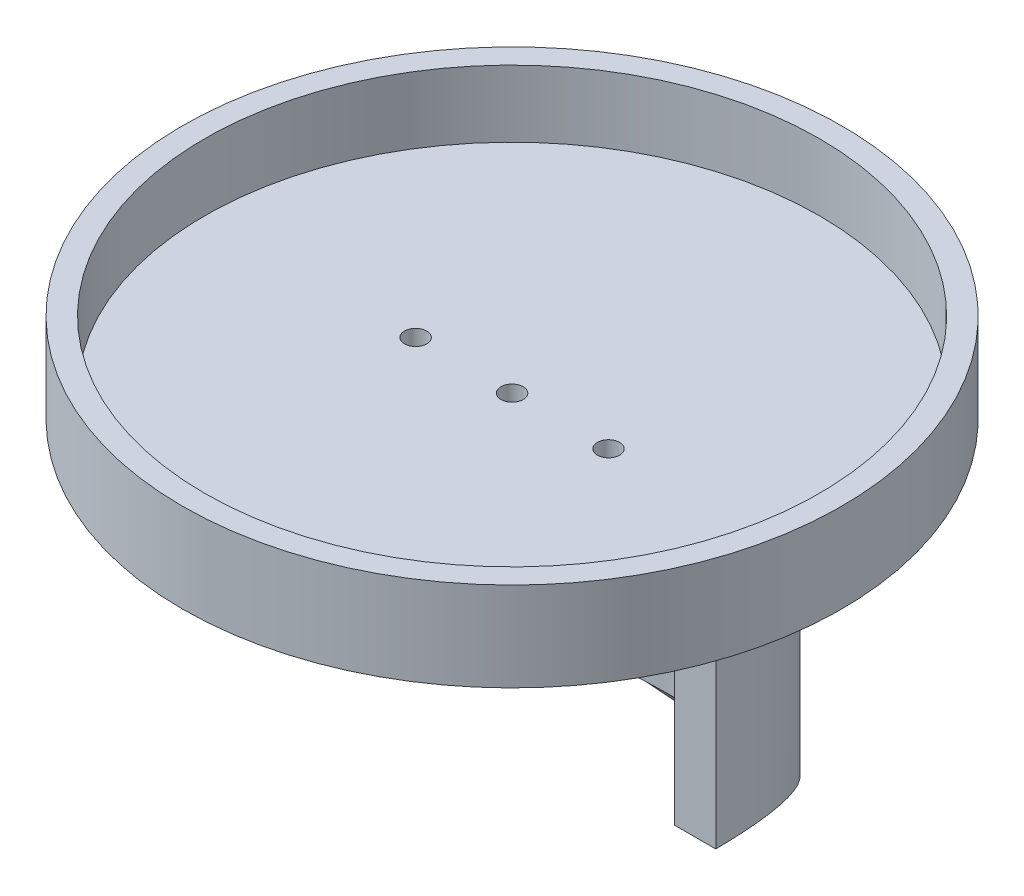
ISO-10303-21;
HEADER;
FILE_DESCRIPTION(('STEP AP214'),'2;1');
FILE_NAME('part.step','',(''),(''),'','','');
FILE_SCHEMA(('AUTOMOTIVE_DESIGN { 1 0 10303 214 1 1 1 1 }'));
ENDSEC;
DATA;
#1=APPLICATION_CONTEXT('core data for automotive mechanical design processes');
#2=APPLICATION_PROTOCOL_DEFINITION('international standard','automotive_design',2000,#1);
#3=PRODUCT_CONTEXT('',#1,'mechanical');
#4=PRODUCT('Part','Part','',(#3));
#5=PRODUCT_RELATED_PRODUCT_CATEGORY('part','',(#4));
#6=PRODUCT_DEFINITION_FORMATION('','',#4);
#7=PRODUCT_DEFINITION_CONTEXT('part definition',#1,'design');
#8=PRODUCT_DEFINITION('design','',#6,#7);
#9=PRODUCT_DEFINITION_SHAPE('','',#8);
#10=(LENGTH_UNIT() NAMED_UNIT(*) SI_UNIT(.MILLI.,.METRE.));
#11=(NAMED_UNIT(*) PLANE_ANGLE_UNIT() SI_UNIT($,.RADIAN.));
#12=(NAMED_UNIT(*) SI_UNIT($,.STERADIAN.) SOLID_ANGLE_UNIT());
#13=UNCERTAINTY_MEASURE_WITH_UNIT(LENGTH_MEASURE(1.E-05),#10,'distance_accuracy_value','');
#14=(GEOMETRIC_REPRESENTATION_CONTEXT(3) GLOBAL_UNCERTAINTY_ASSIGNED_CONTEXT((#13)) GLOBAL_UNIT_ASSIGNED_CONTEXT((#10,
#11,#12)) REPRESENTATION_CONTEXT('',''));
#15=CARTESIAN_POINT('',(0.,0.,0.));
#16=DIRECTION('',(0.,0.,1.));
#17=DIRECTION('',(1.,0.,0.));
#18=AXIS2_PLACEMENT_3D('',#15,#16,#17);
#19=CARTESIAN_POINT('',(-36.5084583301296,5.,-35.0226489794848));
#20=DIRECTION('',(0.,1.,0.));
#21=DIRECTION('',(0.,0.,1.));
#22=AXIS2_PLACEMENT_3D('',#19,#20,#21);
#23=PLANE('',#22);
#24=CARTESIAN_POINT('',(-58.1584583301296,5.,-35.0226489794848));
#25=DIRECTION('',(0.,1.,0.));
#26=DIRECTION('',(0.,0.,1.));
#27=AXIS2_PLACEMENT_3D('',#24,#25,#26);
#28=CIRCLE('',#27,2.5);
#29=CARTESIAN_POINT('',(-58.1584583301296,5.,-32.5226489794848));
#30=VERTEX_POINT('',#29);
#31=EDGE_CURVE('E118',#30,#30,#28,.F.);
#32=ORIENTED_EDGE('',*,*,#31,.T.);
#33=EDGE_LOOP('',(#32));
#34=FACE_BOUND('',#33,.T.);
#35=CARTESIAN_POINT('',(-14.8584583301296,5.,-35.0226489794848));
#36=DIRECTION('',(0.,1.,0.));
#37=DIRECTION('',(0.,0.,1.));
#38=AXIS2_PLACEMENT_3D('',#35,#36,#37);
#39=CIRCLE('',#38,2.5);
#40=CARTESIAN_POINT('',(-14.8584583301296,5.,-32.5226489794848));
#41=VERTEX_POINT('',#40);
#42=EDGE_CURVE('E113',#41,#41,#39,.F.);
#43=ORIENTED_EDGE('',*,*,#42,.T.);
#44=EDGE_LOOP('',(#43));
#45=FACE_BOUND('',#44,.T.);
#46=CARTESIAN_POINT('',(-36.5084583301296,5.,-35.0226489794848));
#47=DIRECTION('',(0.,1.,0.));
#48=DIRECTION('',(0.,0.,1.));
#49=AXIS2_PLACEMENT_3D('',#46,#47,#48);
#50=CIRCLE('',#49,2.5);
#51=CARTESIAN_POINT('',(-36.5084583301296,5.,-32.5226489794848));
#52=VERTEX_POINT('',#51);
#53=EDGE_CURVE('E111',#52,#52,#50,.F.);
#54=ORIENTED_EDGE('',*,*,#53,.T.);
#55=EDGE_LOOP('',(#54));
#56=FACE_BOUND('',#55,.T.);
#57=CARTESIAN_POINT('',(-36.5084583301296,5.,-35.0226489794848));
#58=DIRECTION('',(0.,1.,0.));
#59=DIRECTION('',(0.,0.,1.));
#60=AXIS2_PLACEMENT_3D('',#57,#58,#59);
#61=CIRCLE('',#60,69.);
#62=CARTESIAN_POINT('',(-36.5084583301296,5.,33.9773510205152));
#63=VERTEX_POINT('',#62);
#64=EDGE_CURVE('E11',#63,#63,#61,.F.);
#65=ORIENTED_EDGE('',*,*,#64,.F.);
#66=EDGE_LOOP('',(#65));
#67=FACE_BOUND('',#66,.T.);
#68=ADVANCED_FACE('F37',(#34,#45,#56,#67),#23,.T.);
#69=CARTESIAN_POINT('',(-58.1584583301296,0.,-35.0226489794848));
#70=DIRECTION('',(0.,-1.,0.));
#71=DIRECTION('',(0.,0.,-1.));
#72=AXIS2_PLACEMENT_3D('',#69,#70,#71);
#73=CYLINDRICAL_SURFACE('',#72,2.5);
#74=CARTESIAN_POINT('',(-58.1584583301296,0.,-35.0226489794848));
#75=DIRECTION('',(0.,-1.,0.));
#76=DIRECTION('',(0.,0.,-1.));
#77=AXIS2_PLACEMENT_3D('',#74,#75,#76);
#78=CIRCLE('',#77,2.5);
#79=CARTESIAN_POINT('',(-58.1584583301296,0.,-37.5226489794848));
#80=VERTEX_POINT('',#79);
#81=EDGE_CURVE('E287',#80,#80,#78,.T.);
#82=ORIENTED_EDGE('',*,*,#81,.T.);
#83=EDGE_LOOP('',(#82));
#84=FACE_BOUND('',#83,.T.);
#85=ORIENTED_EDGE('',*,*,#31,.F.);
#86=EDGE_LOOP('',(#85));
#87=FACE_BOUND('',#86,.T.);
#88=ADVANCED_FACE('F173',(#84,#87),#73,.F.);
#89=CARTESIAN_POINT('',(-14.8584583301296,0.,-35.0226489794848));
#90=DIRECTION('',(0.,-1.,0.));
#91=DIRECTION('',(0.,0.,-1.));
#92=AXIS2_PLACEMENT_3D('',#89,#90,#91);
#93=CYLINDRICAL_SURFACE('',#92,2.5);
#94=CARTESIAN_POINT('',(-14.8584583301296,0.,-35.0226489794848));
#95=DIRECTION('',(0.,-1.,0.));
#96=DIRECTION('',(0.,0.,-1.));
#97=AXIS2_PLACEMENT_3D('',#94,#95,#96);
#98=CIRCLE('',#97,2.5);
#99=CARTESIAN_POINT('',(-14.8584583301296,0.,-37.5226489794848));
#100=VERTEX_POINT('',#99);
#101=EDGE_CURVE('E286',#100,#100,#98,.T.);
#102=ORIENTED_EDGE('',*,*,#101,.T.);
#103=EDGE_LOOP('',(#102));
#104=FACE_BOUND('',#103,.T.);
#105=ORIENTED_EDGE('',*,*,#42,.F.);
#106=EDGE_LOOP('',(#105));
#107=FACE_BOUND('',#106,.T.);
#108=ADVANCED_FACE('F178',(#104,#107),#93,.F.);
#109=CARTESIAN_POINT('',(-36.5084583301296,0.,-35.0226489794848));
#110=DIRECTION('',(0.,-1.,0.));
#111=DIRECTION('',(0.,0.,-1.));
#112=AXIS2_PLACEMENT_3D('',#109,#110,#111);
#113=CYLINDRICAL_SURFACE('',#112,2.5);
#114=CARTESIAN_POINT('',(-36.5084583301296,0.,-35.0226489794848));
#115=DIRECTION('',(0.,-1.,0.));
#116=DIRECTION('',(0.,0.,-1.));
#117=AXIS2_PLACEMENT_3D('',#114,#115,#116);
#118=CIRCLE('',#117,2.5);
#119=CARTESIAN_POINT('',(-36.5084583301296,0.,-37.5226489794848));
#120=VERTEX_POINT('',#119);
#121=EDGE_CURVE('E90',#120,#120,#118,.T.);
#122=ORIENTED_EDGE('',*,*,#121,.T.);
#123=EDGE_LOOP('',(#122));
#124=FACE_BOUND('',#123,.T.);
#125=ORIENTED_EDGE('',*,*,#53,.F.);
#126=EDGE_LOOP('',(#125));
#127=FACE_BOUND('',#126,.T.);
#128=ADVANCED_FACE('F143',(#124,#127),#113,.F.);
#129=CARTESIAN_POINT('',(9.23109459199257,-70.,-35.0226489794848));
#130=DIRECTION('',(0.,0.,-1.));
#131=DIRECTION('',(-1.,0.,0.));
#132=AXIS2_PLACEMENT_3D('',#129,#130,#131);
#133=PLANE('',#132);
#134=DIRECTION('',(0.,1.,0.));
#135=VECTOR('',#134,1.);
#136=CARTESIAN_POINT('',(0.,-70.,-35.0226489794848));
#137=LINE('',#136,#135);
#138=CARTESIAN_POINT('',(0.,-60.7797729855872,-35.0226489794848));
#139=VERTEX_POINT('',#138);
#140=CARTESIAN_POINT('',(0.,0.,-35.0226489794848));
#141=VERTEX_POINT('',#140);
#142=EDGE_CURVE('E99',#139,#141,#137,.T.);
#143=ORIENTED_EDGE('',*,*,#142,.F.);
#144=DIRECTION('',(1.,0.,0.));
#145=VECTOR('',#144,1.);
#146=CARTESIAN_POINT('',(-110.50845833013,-60.7797729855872,-35.0226489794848));
#147=LINE('',#146,#145);
#148=CARTESIAN_POINT('',(9.23109459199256,-60.7797729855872,-35.0226489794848));
#149=VERTEX_POINT('',#148);
#150=EDGE_CURVE('E91',#139,#149,#147,.T.);
#151=ORIENTED_EDGE('',*,*,#150,.T.);
#152=DIRECTION('',(0.,1.,0.));
#153=VECTOR('',#152,1.);
#154=CARTESIAN_POINT('',(9.23109459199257,-70.,-35.0226489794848));
#155=LINE('',#154,#153);
#156=CARTESIAN_POINT('',(9.23109459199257,0.,-35.0226489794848));
#157=VERTEX_POINT('',#156);
#158=EDGE_CURVE('E60',#149,#157,#155,.T.);
#159=ORIENTED_EDGE('',*,*,#158,.T.);
#160=DIRECTION('',(-1.,0.,0.));
#161=VECTOR('',#160,1.);
#162=CARTESIAN_POINT('',(9.23109459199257,0.,-35.0226489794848));
#163=LINE('',#162,#161);
#164=EDGE_CURVE('E294',#157,#141,#163,.T.);
#165=ORIENTED_EDGE('',*,*,#164,.T.);
#166=EDGE_LOOP('',(#143,#151,#159,#165));
#167=FACE_BOUND('',#166,.T.);
#168=ADVANCED_FACE('F158',(#167),#133,.F.);
#169=CARTESIAN_POINT('',(-73.0169166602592,-70.,-35.0226489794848));
#170=DIRECTION('',(0.,0.,-1.));
#171=DIRECTION('',(-1.,0.,0.));
#172=AXIS2_PLACEMENT_3D('',#169,#170,#171);
#173=PLANE('',#172);
#174=DIRECTION('',(0.,1.,0.));
#175=VECTOR('',#174,1.);
#176=CARTESIAN_POINT('',(-82.2480112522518,-70.,-35.0226489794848));
#177=LINE('',#176,#175);
#178=CARTESIAN_POINT('',(-82.2480112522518,-60.7797729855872,-35.0226489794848));
#179=VERTEX_POINT('',#178);
#180=CARTESIAN_POINT('',(-82.2480112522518,0.,-35.0226489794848));
#181=VERTEX_POINT('',#180);
#182=EDGE_CURVE('E88',#179,#181,#177,.T.);
#183=ORIENTED_EDGE('',*,*,#182,.F.);
#184=DIRECTION('',(1.,0.,0.));
#185=VECTOR('',#184,1.);
#186=CARTESIAN_POINT('',(-110.50845833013,-60.7797729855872,-35.0226489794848));
#187=LINE('',#186,#185);
#188=CARTESIAN_POINT('',(-73.0169166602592,-60.7797729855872,-35.0226489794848));
#189=VERTEX_POINT('',#188);
#190=EDGE_CURVE('E45',#179,#189,#187,.T.);
#191=ORIENTED_EDGE('',*,*,#190,.T.);
#192=DIRECTION('',(0.,1.,0.));
#193=VECTOR('',#192,1.);
#194=CARTESIAN_POINT('',(-73.0169166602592,-70.,-35.0226489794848));
#195=LINE('',#194,#193);
#196=CARTESIAN_POINT('',(-73.0169166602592,0.,-35.0226489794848));
#197=VERTEX_POINT('',#196);
#198=EDGE_CURVE('E97',#189,#197,#195,.T.);
#199=ORIENTED_EDGE('',*,*,#198,.T.);
#200=DIRECTION('',(-1.,0.,0.));
#201=VECTOR('',#200,1.);
#202=CARTESIAN_POINT('',(-73.0169166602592,0.,-35.0226489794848));
#203=LINE('',#202,#201);
#204=EDGE_CURVE('E96',#197,#181,#203,.T.);
#205=ORIENTED_EDGE('',*,*,#204,.T.);
#206=EDGE_LOOP('',(#183,#191,#199,#205));
#207=FACE_BOUND('',#206,.T.);
#208=ADVANCED_FACE('F94',(#207),#173,.F.);
#209=CARTESIAN_POINT('',(-36.5084583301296,0.,-35.0226489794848));
#210=DIRECTION('',(0.,1.,0.));
#211=DIRECTION('',(0.,0.,1.));
#212=AXIS2_PLACEMENT_3D('',#209,#210,#211);
#213=PLANE('',#212);
#214=ORIENTED_EDGE('',*,*,#121,.F.);
#215=EDGE_LOOP('',(#214));
#216=FACE_BOUND('',#215,.T.);
#217=ORIENTED_EDGE('',*,*,#101,.F.);
#218=EDGE_LOOP('',(#217));
#219=FACE_BOUND('',#218,.T.);
#220=ORIENTED_EDGE('',*,*,#81,.F.);
#221=EDGE_LOOP('',(#220));
#222=FACE_BOUND('',#221,.T.);
#223=CARTESIAN_POINT('',(-36.5084583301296,0.,-35.0226489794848));
#224=DIRECTION('',(0.,1.,0.));
#225=DIRECTION('',(0.,0.,1.));
#226=AXIS2_PLACEMENT_3D('',#223,#224,#225);
#227=CIRCLE('',#226,74.);
#228=CARTESIAN_POINT('',(-36.5084583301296,0.,38.9773510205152));
#229=VERTEX_POINT('',#228);
#230=EDGE_CURVE('E107',#229,#229,#227,.T.);
#231=ORIENTED_EDGE('',*,*,#230,.F.);
#232=EDGE_LOOP('',(#231));
#233=FACE_BOUND('',#232,.T.);
#234=CARTESIAN_POINT('',(-36.5084583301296,0.,-35.0226489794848));
#235=DIRECTION('',(0.,-1.,0.));
#236=DIRECTION('',(0.,0.,1.));
#237=AXIS2_PLACEMENT_3D('',#234,#235,#236);
#238=CIRCLE('',#237,45.7395529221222);
#239=EDGE_CURVE('E289',#181,#157,#238,.T.);
#240=ORIENTED_EDGE('',*,*,#239,.F.);
#241=ORIENTED_EDGE('',*,*,#204,.F.);
#242=CARTESIAN_POINT('',(-36.5084583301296,0.,-35.0226489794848));
#243=DIRECTION('',(0.,1.,0.));
#244=DIRECTION('',(0.,0.,1.));
#245=AXIS2_PLACEMENT_3D('',#242,#243,#244);
#246=CIRCLE('',#245,36.5084583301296);
#247=EDGE_CURVE('E101',#141,#197,#246,.T.);
#248=ORIENTED_EDGE('',*,*,#247,.F.);
#249=ORIENTED_EDGE('',*,*,#164,.F.);
#250=EDGE_LOOP('',(#240,#241,#248,#249));
#251=FACE_BOUND('',#250,.T.);
#252=ADVANCED_FACE('F161',(#216,#219,#222,#233,#251),#213,.F.);
#253=CARTESIAN_POINT('',(-36.5084583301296,20.,-35.0226489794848));
#254=DIRECTION('',(0.,-1.,0.));
#255=DIRECTION('',(0.,0.,-1.));
#256=AXIS2_PLACEMENT_3D('',#253,#254,#255);
#257=CYLINDRICAL_SURFACE('',#256,74.);
#258=CARTESIAN_POINT('',(-36.5084583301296,20.,-35.0226489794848));
#259=DIRECTION('',(0.,1.,0.));
#260=DIRECTION('',(0.,0.,1.));
#261=AXIS2_PLACEMENT_3D('',#258,#259,#260);
#262=CIRCLE('',#261,74.);
#263=CARTESIAN_POINT('',(-36.5084583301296,20.,38.9773510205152));
#264=VERTEX_POINT('',#263);
#265=EDGE_CURVE('E83',#264,#264,#262,.T.);
#266=ORIENTED_EDGE('',*,*,#265,.F.);
#267=EDGE_LOOP('',(#266));
#268=FACE_BOUND('',#267,.T.);
#269=ORIENTED_EDGE('',*,*,#230,.T.);
#270=EDGE_LOOP('',(#269));
#271=FACE_BOUND('',#270,.T.);
#272=ADVANCED_FACE('F39',(#268,#271),#257,.T.);
#273=CARTESIAN_POINT('',(-36.5084583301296,20.,-35.0226489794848));
#274=DIRECTION('',(0.,1.,0.));
#275=DIRECTION('',(0.,0.,1.));
#276=AXIS2_PLACEMENT_3D('',#273,#274,#275);
#277=PLANE('',#276);
#278=ORIENTED_EDGE('',*,*,#265,.T.);
#279=EDGE_LOOP('',(#278));
#280=FACE_BOUND('',#279,.T.);
#281=CARTESIAN_POINT('',(-36.5084583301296,20.,-35.0226489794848));
#282=DIRECTION('',(0.,1.,0.));
#283=DIRECTION('',(0.,0.,1.));
#284=AXIS2_PLACEMENT_3D('',#281,#282,#283);
#285=CIRCLE('',#284,69.);
#286=CARTESIAN_POINT('',(-36.5084583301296,20.,33.9773510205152));
#287=VERTEX_POINT('',#286);
#288=EDGE_CURVE('E114',#287,#287,#285,.T.);
#289=ORIENTED_EDGE('',*,*,#288,.F.);
#290=EDGE_LOOP('',(#289));
#291=FACE_BOUND('',#290,.T.);
#292=ADVANCED_FACE('F157',(#280,#291),#277,.T.);
#293=CARTESIAN_POINT('',(-36.5084583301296,-70.,-35.0226489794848));
#294=DIRECTION('',(0.,1.,0.));
#295=DIRECTION('',(0.,0.,1.));
#296=AXIS2_PLACEMENT_3D('',#293,#294,#295);
#297=CYLINDRICAL_SURFACE('',#296,45.7395529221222);
#298=ORIENTED_EDGE('',*,*,#158,.F.);
#299=CARTESIAN_POINT('',(9.23109459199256,-60.7797729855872,-35.0226489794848));
#300=CARTESIAN_POINT('',(9.23109545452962,-60.7759832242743,-35.3843069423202));
#301=CARTESIAN_POINT('',(9.22680476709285,-60.7752050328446,-35.7459757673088));
#302=CARTESIAN_POINT('',(9.20964917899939,-60.7796661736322,-36.4690712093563));
#303=CARTESIAN_POINT('',(9.19678431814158,-60.7849054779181,-36.8304978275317));
#304=CARTESIAN_POINT('',(9.14535935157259,-60.8096327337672,-37.9136526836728));
#305=CARTESIAN_POINT('',(9.09396884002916,-60.8381261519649,-38.6346277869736));
#306=CARTESIAN_POINT('',(8.95727847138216,-60.9188975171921,-40.0718662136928));
#307=CARTESIAN_POINT('',(8.87198330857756,-60.9711721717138,-40.7881301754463));
#308=CARTESIAN_POINT('',(8.66852478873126,-61.0987621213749,-42.2101458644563));
#309=CARTESIAN_POINT('',(8.55053153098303,-61.1739583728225,-42.9159325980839));
#310=CARTESIAN_POINT('',(8.28219305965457,-61.3469108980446,-44.3185704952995));
#311=CARTESIAN_POINT('',(8.13184572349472,-61.4446686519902,-45.0154210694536));
#312=CARTESIAN_POINT('',(7.79967820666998,-61.6620177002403,-46.3981178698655));
#313=CARTESIAN_POINT('',(7.61785802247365,-61.7816089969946,-47.0839640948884));
#314=CARTESIAN_POINT('',(7.22403020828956,-62.0415939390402,-48.4418599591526));
#315=CARTESIAN_POINT('',(7.01206429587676,-62.1819588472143,-49.1139272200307));
#316=CARTESIAN_POINT('',(6.55887982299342,-62.4826543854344,-50.4435575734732));
#317=CARTESIAN_POINT('',(6.31766137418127,-62.6429849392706,-51.1011207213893));
#318=CARTESIAN_POINT('',(5.8071760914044,-62.982564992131,-52.4002456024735));
#319=CARTESIAN_POINT('',(5.53790991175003,-63.1618140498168,-53.0418077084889));
#320=CARTESIAN_POINT('',(4.9723023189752,-63.5383035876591,-54.3082559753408));
#321=CARTESIAN_POINT('',(4.67593509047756,-63.735561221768,-54.9331254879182));
#322=CARTESIAN_POINT('',(4.05761219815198,-64.1467624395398,-56.1644373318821));
#323=CARTESIAN_POINT('',(3.7356564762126,-64.3607060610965,-56.770879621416));
#324=CARTESIAN_POINT('',(3.06743894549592,-64.8040705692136,-57.9643778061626));
#325=CARTESIAN_POINT('',(2.72117621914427,-65.0334920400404,-58.5514329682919));
#326=CARTESIAN_POINT('',(1.77310548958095,-65.6602979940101,-60.0802326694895));
#327=CARTESIAN_POINT('',(1.15138708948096,-66.0699961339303,-61.0047085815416));
#328=CARTESIAN_POINT('',(-0.149477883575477,-66.9226073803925,-62.7959632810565));
#329=CARTESIAN_POINT('',(-0.828628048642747,-67.3655225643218,-63.6627384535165));
#330=CARTESIAN_POINT('',(-2.23998331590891,-68.2791690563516,-65.3372997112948));
#331=CARTESIAN_POINT('',(-2.97221964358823,-68.7499167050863,-66.1450505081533));
#332=CARTESIAN_POINT('',(-4.48523913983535,-69.7131840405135,-67.6998108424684));
#333=CARTESIAN_POINT('',(-5.26602373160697,-70.2057043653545,-68.4468185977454));
#334=CARTESIAN_POINT('',(-6.70142050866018,-71.0997137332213,-69.7266033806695));
#335=CARTESIAN_POINT('',(-7.34747232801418,-71.4982405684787,-70.271114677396));
#336=CARTESIAN_POINT('',(-8.66628921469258,-72.3018378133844,-71.3218395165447));
#337=CARTESIAN_POINT('',(-9.33905769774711,-72.7069090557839,-71.82804813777));
#338=CARTESIAN_POINT('',(-10.710362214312,-73.5201117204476,-72.8019070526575));
#339=CARTESIAN_POINT('',(-11.4089027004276,-73.9282436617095,-73.269550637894));
#340=CARTESIAN_POINT('',(-12.8313398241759,-74.7437190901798,-74.1660753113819));
#341=CARTESIAN_POINT('',(-13.5552459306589,-75.1510622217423,-74.5949417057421));
#342=CARTESIAN_POINT('',(-15.0278613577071,-75.9601385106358,-75.41324383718));
#343=CARTESIAN_POINT('',(-15.7765665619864,-76.3618725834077,-75.8026860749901));
#344=CARTESIAN_POINT('',(-17.2989759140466,-77.154212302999,-76.5415391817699));
#345=CARTESIAN_POINT('',(-18.0726730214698,-77.5448210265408,-76.8909612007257));
#346=CARTESIAN_POINT('',(-19.3797195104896,-78.179035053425,-77.4376370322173));
#347=CARTESIAN_POINT('',(-19.9058480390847,-78.4276745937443,-77.6463840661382));
#348=CARTESIAN_POINT('',(-20.9696172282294,-78.9147164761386,-78.0455945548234));
#349=CARTESIAN_POINT('',(-21.5072566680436,-79.1531198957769,-78.2360599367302));
#350=CARTESIAN_POINT('',(-22.5944204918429,-79.6169858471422,-78.5982680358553));
#351=CARTESIAN_POINT('',(-23.1439465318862,-79.8424465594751,-78.7700081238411));
#352=CARTESIAN_POINT('',(-24.2540316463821,-80.2767980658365,-79.0938345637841));
#353=CARTESIAN_POINT('',(-24.8145692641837,-80.4857177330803,-79.2459554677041));
#354=CARTESIAN_POINT('',(-25.9476201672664,-80.8837627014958,-79.5301371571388));
#355=CARTESIAN_POINT('',(-26.5201324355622,-81.072889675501,-79.662199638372));
#356=CARTESIAN_POINT('',(-27.6768339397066,-81.4272561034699,-79.9053652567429));
#357=CARTESIAN_POINT('',(-28.2610206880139,-81.5925005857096,-80.0164728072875));
#358=CARTESIAN_POINT('',(-29.3088258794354,-81.8610529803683,-80.1944095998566));
#359=CARTESIAN_POINT('',(-29.7702747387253,-81.9699548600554,-80.2655874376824));
#360=CARTESIAN_POINT('',(-30.6991573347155,-82.1686665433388,-80.3942095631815));
#361=CARTESIAN_POINT('',(-31.1665905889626,-82.2584778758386,-80.4516549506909));
#362=CARTESIAN_POINT('',(-32.1065196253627,-82.4170818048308,-80.5523426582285));
#363=CARTESIAN_POINT('',(-32.5790150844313,-82.4858757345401,-80.5955858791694));
#364=CARTESIAN_POINT('',(-33.5268584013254,-82.6006833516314,-80.66738739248));
#365=CARTESIAN_POINT('',(-34.0021979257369,-82.6467457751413,-80.6959771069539));
#366=CARTESIAN_POINT('',(-34.9552965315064,-82.7151242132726,-80.7383130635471));
#367=CARTESIAN_POINT('',(-35.4330558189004,-82.7374381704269,-80.7520580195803));
#368=CARTESIAN_POINT('',(-36.3892473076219,-82.7577057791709,-80.7645453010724));
#369=CARTESIAN_POINT('',(-36.8676794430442,-82.7556616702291,-80.7632890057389));
#370=CARTESIAN_POINT('',(-37.8237571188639,-82.7272684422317,-80.7457875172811));
#371=CARTESIAN_POINT('',(-38.3014022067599,-82.7009083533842,-80.7295355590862));
#372=CARTESIAN_POINT('',(-39.2540897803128,-82.6245763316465,-80.6822121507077));
#373=CARTESIAN_POINT('',(-39.7291320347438,-82.5746023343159,-80.6511394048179));
#374=CARTESIAN_POINT('',(-40.6751017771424,-82.4523234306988,-80.5744982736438));
#375=CARTESIAN_POINT('',(-41.146029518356,-82.3800199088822,-80.5289307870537));
#376=CARTESIAN_POINT('',(-42.0838584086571,-82.214561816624,-80.4235837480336));
#377=CARTESIAN_POINT('',(-42.5507458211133,-82.1213532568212,-80.3637673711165));
#378=CARTESIAN_POINT('',(-43.4783886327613,-81.9161549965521,-80.2304620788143));
#379=CARTESIAN_POINT('',(-43.9391438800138,-81.8041648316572,-80.1569728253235));
#380=CARTESIAN_POINT('',(-44.8539614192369,-81.5634629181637,-79.9968079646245));
#381=CARTESIAN_POINT('',(-45.3080229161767,-81.4347492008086,-79.910130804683));
#382=CARTESIAN_POINT('',(-46.4900146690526,-81.07782642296,-79.6660476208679));
#383=CARTESIAN_POINT('',(-47.2122021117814,-80.837616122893,-79.4982358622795));
#384=CARTESIAN_POINT('',(-48.6376809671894,-80.3266513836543,-79.130821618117));
#385=CARTESIAN_POINT('',(-49.3409621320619,-80.0558807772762,-78.9312022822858));
#386=CARTESIAN_POINT('',(-50.7287061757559,-79.4908847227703,-78.5015972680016));
#387=CARTESIAN_POINT('',(-51.4131645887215,-79.1966537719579,-78.27160445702));
#388=CARTESIAN_POINT('',(-52.76541436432,-78.5898854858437,-77.7817025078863));
#389=CARTESIAN_POINT('',(-53.4331551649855,-78.2773003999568,-77.5217134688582));
#390=CARTESIAN_POINT('',(-54.7503532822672,-77.6395729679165,-76.9732004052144));
#391=CARTESIAN_POINT('',(-55.3998160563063,-77.3144344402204,-76.6846850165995));
#392=CARTESIAN_POINT('',(-56.6811176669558,-76.6555536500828,-76.0795912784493));
#393=CARTESIAN_POINT('',(-57.3129550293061,-76.3218106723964,-75.7630105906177));
#394=CARTESIAN_POINT('',(-58.5590035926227,-75.6492391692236,-75.1022860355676));
#395=CARTESIAN_POINT('',(-59.1732192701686,-75.3104119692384,-74.7581492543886));
#396=CARTESIAN_POINT('',(-60.3842636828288,-74.6304501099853,-74.0424818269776));
#397=CARTESIAN_POINT('',(-60.9810906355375,-74.2893152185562,-73.6709483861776));
#398=CARTESIAN_POINT('',(-62.1572573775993,-73.6071951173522,-72.9006125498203));
#399=CARTESIAN_POINT('',(-62.7365923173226,-73.2662099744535,-72.5018026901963));
#400=CARTESIAN_POINT('',(-63.8771918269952,-72.5867307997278,-71.6771758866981));
#401=CARTESIAN_POINT('',(-64.4384569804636,-72.2482366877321,-71.2513598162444));
#402=CARTESIAN_POINT('',(-65.5414732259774,-71.5762981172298,-70.3735574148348));
#403=CARTESIAN_POINT('',(-66.0832541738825,-71.2428464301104,-69.9216141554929));
#404=CARTESIAN_POINT('',(-67.14750798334,-70.5823081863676,-68.9910898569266));
#405=CARTESIAN_POINT('',(-67.6699804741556,-70.2552217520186,-68.5125083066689));
#406=CARTESIAN_POINT('',(-68.694548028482,-69.6092891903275,-67.5290537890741));
#407=CARTESIAN_POINT('',(-69.1966494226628,-69.2904405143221,-67.024189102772));
#408=CARTESIAN_POINT('',(-70.1795859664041,-68.6625819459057,-65.9883036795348));
#409=CARTESIAN_POINT('',(-70.6604200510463,-68.3535725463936,-65.4572816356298));
#410=CARTESIAN_POINT('',(-71.89070088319,-67.5590954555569,-64.032270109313));
#411=CARTESIAN_POINT('',(-72.6220046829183,-67.0829123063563,-63.1172305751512));
#412=CARTESIAN_POINT('',(-74.019904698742,-66.1676791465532,-61.2215960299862));
#413=CARTESIAN_POINT('',(-74.6865062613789,-65.7286260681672,-60.2410064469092));
#414=CARTESIAN_POINT('',(-75.9488364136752,-64.8942610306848,-58.217169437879));
#415=CARTESIAN_POINT('',(-76.5445534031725,-64.4989562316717,-57.1739117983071));
#416=CARTESIAN_POINT('',(-77.6581801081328,-63.7587727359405,-55.0293029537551));
#417=CARTESIAN_POINT('',(-78.1760920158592,-63.4138926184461,-53.9279533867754));
#418=CARTESIAN_POINT('',(-78.9712975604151,-62.8846154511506,-52.0429665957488));
#419=CARTESIAN_POINT('',(-79.2718463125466,-62.6846494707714,-51.2733973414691));
#420=CARTESIAN_POINT('',(-79.8326456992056,-62.3121154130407,-49.7130734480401));
#421=CARTESIAN_POINT('',(-80.0928932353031,-62.1395494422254,-48.9223171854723));
#422=CARTESIAN_POINT('',(-80.5711830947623,-61.8234510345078,-47.3222595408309));
#423=CARTESIAN_POINT('',(-80.7892169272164,-61.679924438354,-46.5129544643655));
#424=CARTESIAN_POINT('',(-81.1808416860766,-61.4236857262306,-44.8810049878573));
#425=CARTESIAN_POINT('',(-81.3545417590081,-61.3108978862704,-44.0583987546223));
#426=CARTESIAN_POINT('',(-81.6567625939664,-61.1168515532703,-42.4014351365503));
#427=CARTESIAN_POINT('',(-81.7852923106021,-61.0355868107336,-41.5670801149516));
#428=CARTESIAN_POINT('',(-81.9960596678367,-60.9054803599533,-39.890671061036));
#429=CARTESIAN_POINT('',(-82.0783379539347,-60.856610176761,-39.0486244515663));
#430=CARTESIAN_POINT('',(-82.1556707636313,-60.8139912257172,-37.9397106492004));
#431=CARTESIAN_POINT('',(-82.1718330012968,-60.8054309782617,-37.6747138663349));
#432=CARTESIAN_POINT('',(-82.1995420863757,-60.791549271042,-37.1444432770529));
#433=CARTESIAN_POINT('',(-82.2110899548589,-60.7862270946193,-36.8791695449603));
#434=CARTESIAN_POINT('',(-82.2295527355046,-60.7788310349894,-36.3487570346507));
#435=CARTESIAN_POINT('',(-82.2364735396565,-60.7767530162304,-36.0836185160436));
#436=CARTESIAN_POINT('',(-82.2457036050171,-60.7758338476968,-35.5531977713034));
#437=CARTESIAN_POINT('',(-82.248011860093,-60.7769934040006,-35.2879155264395));
#438=CARTESIAN_POINT('',(-82.2480112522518,-60.7797729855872,-35.0226489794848));
#439=B_SPLINE_CURVE_WITH_KNOTS('',3,(#299,#300,#301,#302,#303,#304,#305,#306,#307,#308,#309,
#310,#311,#312,#313,#314,#315,#316,#317,#318,#319,#320,#321,#322,#323,#324,#325,#326,#327,#328,
#329,#330,#331,#332,#333,#334,#335,#336,#337,#338,#339,#340,#341,#342,#343,#344,#345,#346,#347,
#348,#349,#350,#351,#352,#353,#354,#355,#356,#357,#358,#359,#360,#361,#362,#363,#364,#365,#366,
#367,#368,#369,#370,#371,#372,#373,#374,#375,#376,#377,#378,#379,#380,#381,#382,#383,#384,#385,
#386,#387,#388,#389,#390,#391,#392,#393,#394,#395,#396,#397,#398,#399,#400,#401,#402,#403,#404,
#405,#406,#407,#408,#409,#410,#411,#412,#413,#414,#415,#416,#417,#418,#419,#420,#421,#422,#423,
#424,#425,#426,#427,#428,#429,#430,#431,#432,#433,#434,#435,#436,#437,#438),.UNSPECIFIED.,.F.,
.F.,(4,2,2,2,2,2,2,2,2,2,2,2,2,2,2,2,2,2,2,2,2,2,2,2,2,2,2,2,2,2,2,2,2,2,2,2,2,2,2,2,2,2,2,2,2,
2,2,2,2,2,2,2,2,2,2,2,2,2,2,2,2,2,2,2,2,2,2,2,2,4),(0.,1.08495417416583,2.16990331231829,
4.33868763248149,6.50717177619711,8.66458039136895,10.8221305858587,12.9796810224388,
15.1342742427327,17.2888592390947,19.44339398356,21.6000028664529,23.7566166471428,
25.9133118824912,29.470727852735,33.0283664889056,36.5881149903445,40.1479678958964,
42.9493708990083,45.7511332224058,48.5533818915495,51.356688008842,54.15953112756,
56.9615914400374,58.8158804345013,60.6699737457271,62.5243270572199,64.3753686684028,
66.2262537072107,68.076748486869,69.5145129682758,70.9521622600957,72.3897203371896,
73.824182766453,75.2587694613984,76.6932242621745,78.1283265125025,79.5635542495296,
80.9986930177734,82.4375817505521,83.8765060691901,85.3155999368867,87.6518829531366,
89.9894077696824,92.3274824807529,94.6719355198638,97.0156809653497,99.3596218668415,
101.702961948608,104.046541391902,106.390764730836,108.734912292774,111.075299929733,
113.415732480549,115.755432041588,118.0952486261,121.884680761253,125.673799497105,
129.463537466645,133.253168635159,135.801769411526,138.350566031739,140.899874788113,
143.442845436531,145.985311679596,148.525540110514,149.322385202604,150.11905387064,
150.914706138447,151.710531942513),.UNSPECIFIED.);
#440=EDGE_CURVE('E79',#149,#179,#439,.T.);
#441=ORIENTED_EDGE('',*,*,#440,.T.);
#442=ORIENTED_EDGE('',*,*,#182,.T.);
#443=ORIENTED_EDGE('',*,*,#239,.T.);
#444=EDGE_LOOP('',(#298,#441,#442,#443));
#445=FACE_BOUND('',#444,.T.);
#446=ADVANCED_FACE('F86',(#445),#297,.T.);
#447=CARTESIAN_POINT('',(-36.5084583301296,-70.,-35.0226489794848));
#448=DIRECTION('',(0.,1.,0.));
#449=DIRECTION('',(0.,0.,1.));
#450=AXIS2_PLACEMENT_3D('',#447,#448,#449);
#451=CYLINDRICAL_SURFACE('',#450,36.5084583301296);
#452=ORIENTED_EDGE('',*,*,#198,.F.);
#453=CARTESIAN_POINT('',(-73.0169166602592,-60.7797729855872,-35.0226489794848));
#454=CARTESIAN_POINT('',(-73.0169491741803,-60.7732598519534,-35.6414777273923));
#455=CARTESIAN_POINT('',(-73.0011839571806,-60.7756163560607,-36.2603903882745));
#456=CARTESIAN_POINT('',(-72.9382764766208,-60.7978860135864,-37.4960702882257));
#457=CARTESIAN_POINT('',(-72.8911460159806,-60.8177925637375,-38.1128382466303));
#458=CARTESIAN_POINT('',(-72.765734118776,-60.8749714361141,-39.3423061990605));
#459=CARTESIAN_POINT('',(-72.6874566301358,-60.912241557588,-39.955006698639));
#460=CARTESIAN_POINT('',(-72.5006043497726,-61.0035534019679,-41.171629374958));
#461=CARTESIAN_POINT('',(-72.3921692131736,-61.0575179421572,-41.7755788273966));
#462=CARTESIAN_POINT('',(-72.1454092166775,-61.1817588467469,-42.9756723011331));
#463=CARTESIAN_POINT('',(-72.0070826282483,-61.2520361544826,-43.5718158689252));
#464=CARTESIAN_POINT('',(-71.7012429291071,-61.4082427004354,-44.7544784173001));
#465=CARTESIAN_POINT('',(-71.5337298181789,-61.4941719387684,-45.3409973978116));
#466=CARTESIAN_POINT('',(-71.1705349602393,-61.6807944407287,-46.5020901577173));
#467=CARTESIAN_POINT('',(-70.97488579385,-61.7814706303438,-47.0766768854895));
#468=CARTESIAN_POINT('',(-70.5561671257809,-61.99677395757,-48.2130907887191));
#469=CARTESIAN_POINT('',(-70.3330976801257,-62.1114010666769,-48.7749179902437));
#470=CARTESIAN_POINT('',(-69.8604930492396,-62.3536253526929,-49.8844425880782));
#471=CARTESIAN_POINT('',(-69.6109583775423,-62.4812222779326,-50.4321402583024));
#472=CARTESIAN_POINT('',(-69.0862058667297,-62.7484310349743,-51.5126121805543));
#473=CARTESIAN_POINT('',(-68.8109684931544,-62.8880519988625,-52.0453746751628));
#474=CARTESIAN_POINT('',(-68.2359657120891,-63.1780994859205,-53.0944666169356));
#475=CARTESIAN_POINT('',(-67.9362002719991,-63.3285260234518,-53.6107960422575));
#476=CARTESIAN_POINT('',(-67.3131460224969,-63.6389885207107,-54.626056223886));
#477=CARTESIAN_POINT('',(-66.989856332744,-63.7990248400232,-55.1249863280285));
#478=CARTESIAN_POINT('',(-66.1160666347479,-64.2279271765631,-56.4041978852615));
#479=CARTESIAN_POINT('',(-65.5474968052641,-64.5035097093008,-57.1699970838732));
#480=CARTESIAN_POINT('',(-64.355620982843,-65.0709613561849,-58.651170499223));
#481=CARTESIAN_POINT('',(-63.7323125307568,-65.3628312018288,-59.3665424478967));
#482=CARTESIAN_POINT('',(-62.4337047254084,-65.9573757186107,-60.7451436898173));
#483=CARTESIAN_POINT('',(-61.7583515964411,-66.2600613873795,-61.4083175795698));
#484=CARTESIAN_POINT('',(-60.3593204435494,-66.8697057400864,-62.6794261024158));
#485=CARTESIAN_POINT('',(-59.6356401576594,-67.1766646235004,-63.2873581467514));
#486=CARTESIAN_POINT('',(-58.0540350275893,-67.8244234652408,-64.5145613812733));
#487=CARTESIAN_POINT('',(-57.1903700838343,-68.164917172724,-65.1266189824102));
#488=CARTESIAN_POINT('',(-55.4092803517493,-68.8325038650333,-66.2756452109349));
#489=CARTESIAN_POINT('',(-54.4918463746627,-69.1595945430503,-66.8126009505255));
#490=CARTESIAN_POINT('',(-52.6077380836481,-69.788461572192,-67.8070098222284));
#491=CARTESIAN_POINT('',(-51.6411134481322,-70.0902626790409,-68.2645411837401));
#492=CARTESIAN_POINT('',(-49.6620666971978,-70.6561500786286,-69.0961147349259));
#493=CARTESIAN_POINT('',(-48.649660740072,-70.9202495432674,-69.470186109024));
#494=CARTESIAN_POINT('',(-46.8294311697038,-71.3408617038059,-70.0516292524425));
#495=CARTESIAN_POINT('',(-46.0299362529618,-71.5080415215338,-70.2774995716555));
#496=CARTESIAN_POINT('',(-44.410985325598,-71.8068400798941,-70.675302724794));
#497=CARTESIAN_POINT('',(-43.5915323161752,-71.9384641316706,-70.8472436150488));
#498=CARTESIAN_POINT('',(-42.3516709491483,-72.1052416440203,-71.0629087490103));
#499=CARTESIAN_POINT('',(-41.936847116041,-72.1557039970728,-71.1277307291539));
#500=CARTESIAN_POINT('',(-41.1040830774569,-72.2459461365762,-71.2431454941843));
#501=CARTESIAN_POINT('',(-40.686143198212,-72.2857270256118,-71.2937397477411));
#502=CARTESIAN_POINT('',(-39.8478192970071,-72.3541627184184,-71.3805065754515));
#503=CARTESIAN_POINT('',(-39.4274350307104,-72.3828163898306,-71.4166776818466));
#504=CARTESIAN_POINT('',(-38.5850783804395,-72.4286644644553,-71.4744446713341));
#505=CARTESIAN_POINT('',(-38.1631061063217,-72.4458596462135,-71.4960415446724));
#506=CARTESIAN_POINT('',(-37.1758244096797,-72.4724170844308,-71.5293814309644));
#507=CARTESIAN_POINT('',(-36.6101795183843,-72.477180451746,-71.5353429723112));
#508=CARTESIAN_POINT('',(-35.4794312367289,-72.4657297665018,-71.5209830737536));
#509=CARTESIAN_POINT('',(-34.9143278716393,-72.4495147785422,-71.5006604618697));
#510=CARTESIAN_POINT('',(-33.7866641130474,-72.3964538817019,-71.4338885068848));
#511=CARTESIAN_POINT('',(-33.2241036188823,-72.3596087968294,-71.3874402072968));
#512=CARTESIAN_POINT('',(-32.1029094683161,-72.2660097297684,-71.2687075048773));
#513=CARTESIAN_POINT('',(-31.544279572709,-72.2092387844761,-71.1964010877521));
#514=CARTESIAN_POINT('',(-30.4331275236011,-72.076915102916,-71.0264511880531));
#515=CARTESIAN_POINT('',(-29.8806055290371,-72.0013618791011,-70.9288070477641));
#516=CARTESIAN_POINT('',(-28.7832355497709,-71.8328919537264,-70.7088043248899));
#517=CARTESIAN_POINT('',(-28.2383874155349,-71.7399755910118,-70.5864462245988));
#518=CARTESIAN_POINT('',(-26.9095256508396,-71.4920896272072,-70.2559848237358));
#519=CARTESIAN_POINT('',(-26.1305131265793,-71.3282123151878,-70.034301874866));
#520=CARTESIAN_POINT('',(-24.594629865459,-70.9722490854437,-69.5419024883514));
#521=CARTESIAN_POINT('',(-23.837764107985,-70.7801568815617,-69.2711751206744));
#522=CARTESIAN_POINT('',(-22.7210585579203,-70.4750522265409,-68.8299772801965));
#523=CARTESIAN_POINT('',(-22.3518552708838,-70.3705019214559,-68.6770284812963));
#524=CARTESIAN_POINT('',(-21.6199675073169,-70.1564406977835,-68.3597065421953));
#525=CARTESIAN_POINT('',(-21.2572814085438,-70.0469310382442,-68.1953362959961));
#526=CARTESIAN_POINT('',(-20.1790914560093,-69.7118856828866,-67.6853432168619));
#527=CARTESIAN_POINT('',(-19.4735073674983,-69.4798478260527,-67.3228584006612));
#528=CARTESIAN_POINT('',(-17.9535118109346,-68.9563592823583,-66.478646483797));
#529=CARTESIAN_POINT('',(-17.1452377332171,-68.6622461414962,-65.9875236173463));
#530=CARTESIAN_POINT('',(-15.5715436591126,-68.0644675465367,-64.9459440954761));
#531=CARTESIAN_POINT('',(-14.8061277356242,-67.7608011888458,-64.3954818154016));
#532=CARTESIAN_POINT('',(-13.3201277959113,-67.1509906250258,-63.2371295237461));
#533=CARTESIAN_POINT('',(-12.5995762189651,-66.844844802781,-62.6291987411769));
#534=CARTESIAN_POINT('',(-11.2066077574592,-66.2369637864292,-61.3584194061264));
#535=CARTESIAN_POINT('',(-10.5341932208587,-65.9352288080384,-60.6955681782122));
#536=CARTESIAN_POINT('',(-9.15130631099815,-65.3014435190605,-59.2220366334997));
#537=CARTESIAN_POINT('',(-8.44837318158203,-64.970950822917,-58.4035758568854));
#538=CARTESIAN_POINT('',(-7.11394484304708,-64.3321669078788,-56.7021172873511));
#539=CARTESIAN_POINT('',(-6.48245784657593,-64.023878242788,-55.8191120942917));
#540=CARTESIAN_POINT('',(-5.29652503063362,-63.4373526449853,-53.992824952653));
#541=CARTESIAN_POINT('',(-4.74209030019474,-63.1591200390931,-53.0495343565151));
#542=CARTESIAN_POINT('',(-3.97313244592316,-62.7699759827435,-51.594355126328));
#543=CARTESIAN_POINT('',(-3.72724372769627,-62.6449525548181,-51.102544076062));
#544=CARTESIAN_POINT('',(-3.25707202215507,-62.4051218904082,-50.1062860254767));
#545=CARTESIAN_POINT('',(-3.03278687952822,-62.2903136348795,-49.6018402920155));
#546=CARTESIAN_POINT('',(-2.55400270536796,-62.0447570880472,-48.4553599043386));
#547=CARTESIAN_POINT('',(-2.30569254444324,-61.9170598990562,-47.8100726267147));
#548=CARTESIAN_POINT('',(-1.84521417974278,-61.6802257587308,-46.5033689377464));
#549=CARTESIAN_POINT('',(-1.63304715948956,-61.5710894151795,-45.8419519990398));
#550=CARTESIAN_POINT('',(-1.24610931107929,-61.3726257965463,-44.5051861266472));
#551=CARTESIAN_POINT('',(-1.07134585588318,-61.2833024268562,-43.8298344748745));
#552=CARTESIAN_POINT('',(-0.760834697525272,-61.1257884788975,-42.4698003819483));
#553=CARTESIAN_POINT('',(-0.624978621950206,-61.0575391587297,-41.7851495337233));
#554=CARTESIAN_POINT('',(-0.392559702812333,-60.9426877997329,-40.4075612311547));
#555=CARTESIAN_POINT('',(-0.295989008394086,-60.8960814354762,-39.7146254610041));
#556=CARTESIAN_POINT('',(-0.142829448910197,-60.8251258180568,-38.3237808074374));
#557=CARTESIAN_POINT('',(-0.0862047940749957,-60.8007566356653,-37.6258769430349));
#558=CARTESIAN_POINT('',(-0.0331232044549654,-60.7816943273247,-36.6096092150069));
#559=CARTESIAN_POINT('',(-0.0206957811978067,-60.7780622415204,-36.2921574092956));
#560=CARTESIAN_POINT('',(-0.00413847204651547,-60.7754413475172,-35.6573528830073));
#561=CARTESIAN_POINT('',(1.37950369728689E-07,-60.7764476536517,-35.3400004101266));
#562=CARTESIAN_POINT('',(0.,-60.7797729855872,-35.0226489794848));
#563=B_SPLINE_CURVE_WITH_KNOTS('',3,(#453,#454,#455,#456,#457,#458,#459,#460,#461,#462,#463,
#464,#465,#466,#467,#468,#469,#470,#471,#472,#473,#474,#475,#476,#477,#478,#479,#480,#481,#482,
#483,#484,#485,#486,#487,#488,#489,#490,#491,#492,#493,#494,#495,#496,#497,#498,#499,#500,#501,
#502,#503,#504,#505,#506,#507,#508,#509,#510,#511,#512,#513,#514,#515,#516,#517,#518,#519,#520,
#521,#522,#523,#524,#525,#526,#527,#528,#529,#530,#531,#532,#533,#534,#535,#536,#537,#538,#539,
#540,#541,#542,#543,#544,#545,#546,#547,#548,#549,#550,#551,#552,#553,#554,#555,#556,#557,#558,
#559,#560,#561,#562),.UNSPECIFIED.,.F.,.F.,(4,2,2,2,2,2,2,2,2,2,2,2,2,2,2,2,2,2,2,2,2,2,2,2,2,2,
2,2,2,2,2,2,2,2,2,2,2,2,2,2,2,2,2,2,2,2,2,2,2,2,2,2,2,2,4),(0.,1.85631066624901,
3.71192318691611,5.56730058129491,7.41422512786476,9.26125650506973,11.1082878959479,
12.953197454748,14.7981032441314,16.6429732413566,18.4892569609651,20.3355431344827,
22.1818984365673,25.1570896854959,28.1324146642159,31.1108562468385,34.0894373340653,
37.4214409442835,40.7540156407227,44.0832890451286,47.4113964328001,49.9513607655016,
52.4909454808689,53.7592679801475,55.0274595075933,56.2957800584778,57.5640144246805,
59.2600585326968,60.9561782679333,62.6522302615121,64.3497296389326,66.0472730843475,
67.74478340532,70.2213788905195,72.6985269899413,73.9375621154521,75.1762844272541,
77.6539000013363,80.6224244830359,83.5912305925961,86.5621589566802,89.5332321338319,
92.9140265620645,96.2952092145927,99.6768779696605,101.368003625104,103.058960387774,
105.166917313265,107.274943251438,109.383384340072,111.48589416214,113.587983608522,
115.688187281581,116.641215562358,117.59324023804),.UNSPECIFIED.);
#564=EDGE_CURVE('E52',#189,#139,#563,.T.);
#565=ORIENTED_EDGE('',*,*,#564,.T.);
#566=ORIENTED_EDGE('',*,*,#142,.T.);
#567=ORIENTED_EDGE('',*,*,#247,.T.);
#568=EDGE_LOOP('',(#452,#565,#566,#567));
#569=FACE_BOUND('',#568,.T.);
#570=ADVANCED_FACE('F141',(#569),#451,.F.);
#571=CARTESIAN_POINT('',(-110.50845833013,-100.124878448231,-35.0226489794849));
#572=DIRECTION('',(1.,0.,0.));
#573=DIRECTION('',(0.,0.0264058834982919,-0.99965130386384));
#574=AXIS2_PLACEMENT_3D('',#571,#572,#573);
#575=ELLIPSE('',#574,50.6514371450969,39.3396624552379);
#576=DIRECTION('',(1.,0.,0.));
#577=VECTOR('',#576,1.);
#578=SURFACE_OF_LINEAR_EXTRUSION('',#575,#577);
#579=ORIENTED_EDGE('',*,*,#150,.F.);
#580=ORIENTED_EDGE('',*,*,#564,.F.);
#581=ORIENTED_EDGE('',*,*,#190,.F.);
#582=ORIENTED_EDGE('',*,*,#440,.F.);
#583=EDGE_LOOP('',(#579,#580,#581,#582));
#584=FACE_BOUND('',#583,.T.);
#585=ADVANCED_FACE('F78',(#584),#578,.F.);
#586=CARTESIAN_POINT('',(-36.5084583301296,20.,-35.0226489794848));
#587=DIRECTION('',(0.,-1.,0.));
#588=DIRECTION('',(0.,0.,-1.));
#589=AXIS2_PLACEMENT_3D('',#586,#587,#588);
#590=CYLINDRICAL_SURFACE('',#589,69.);
#591=ORIENTED_EDGE('',*,*,#288,.T.);
#592=EDGE_LOOP('',(#591));
#593=FACE_BOUND('',#592,.T.);
#594=ORIENTED_EDGE('',*,*,#64,.T.);
#595=EDGE_LOOP('',(#594));
#596=FACE_BOUND('',#595,.T.);
#597=ADVANCED_FACE('F140',(#593,#596),#590,.F.);
#598=CLOSED_SHELL('',(#68,#88,#108,#128,#168,#208,#252,#272,#292,#446,#570,#585,#597));
#599=MANIFOLD_SOLID_BREP('B2',#598);
#600=ADVANCED_BREP_SHAPE_REPRESENTATION('',(#18,#599),#14);
#601=SHAPE_DEFINITION_REPRESENTATION(#9,#600);
ENDSEC;
END-ISO-10303-21;
